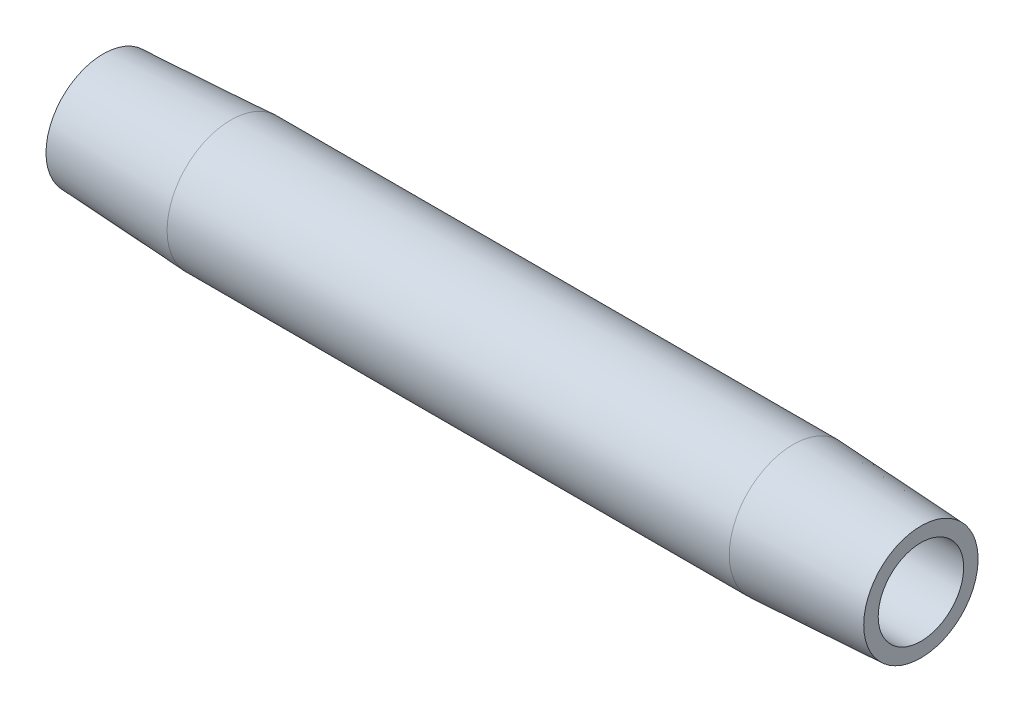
from build123d import *


with BuildPart() as part:
    # Sketch2 → Revolve1 (revolve)
    with BuildSketch(Plane.XY, mode=Mode.PRIVATE) as revolve1_sk:
        Polygon((7.9375, 3.96875), (0, 3.552763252), (0, 2.6543), (50.8, 2.6543), (50.8, 3.552763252), (42.8625, 3.96875), align=None)
    revolve(revolve1_sk.sketch.rotate(Axis((0.476141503, 0, 0), (1, 0, 0)), 90), axis=Axis((0.476141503, 0, 0), (1, 0, 0)))


solid = part.part
